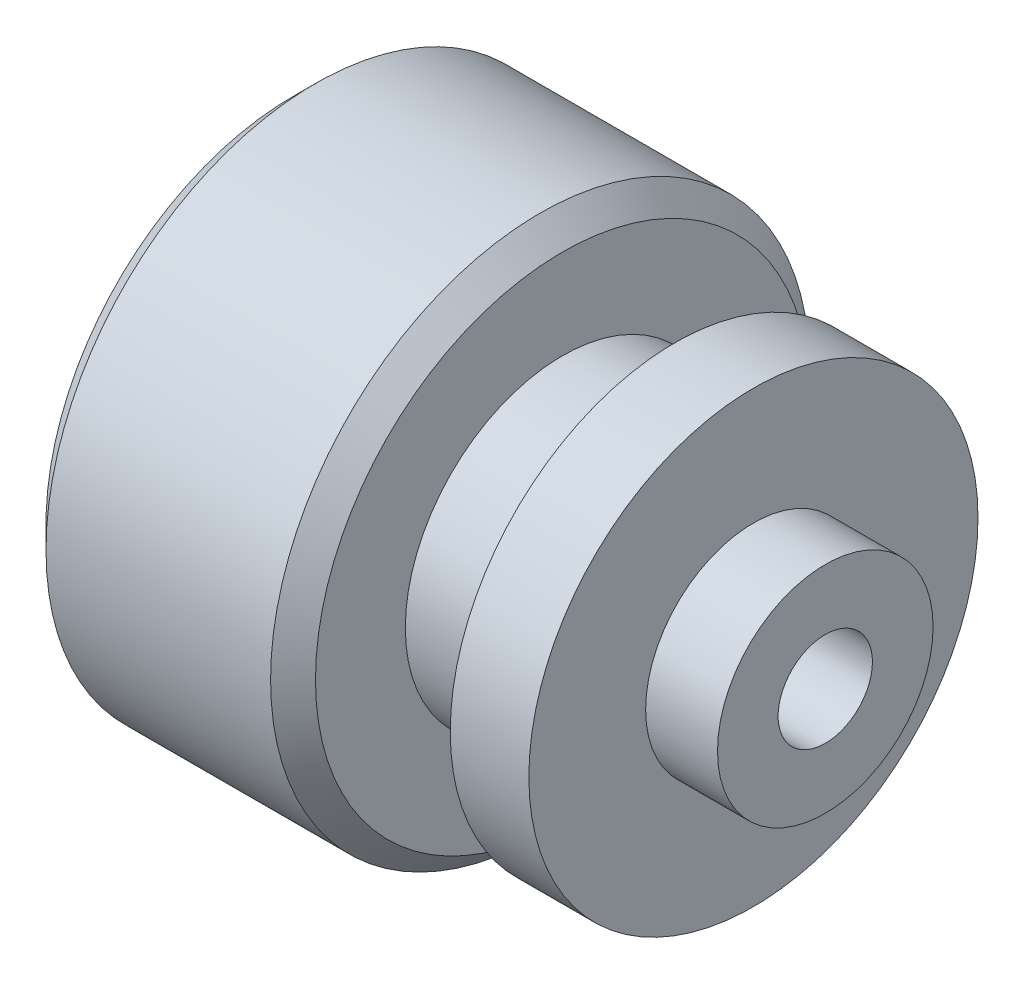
from build123d import *

# Parameters (mm, degrees)
M5_TAPPED_HOLE1_D = 4.2
SKETCH9_R         = 2.5
EXTRUDE1_DEPTH    = 12
CHAMFER1_SIZE     = 1


with BuildPart() as part:
    # Sketch1 → Revolve1 (revolve)
    with BuildSketch(Plane.XY, mode=Mode.PRIVATE) as revolve1_sk:
        Polygon((0, 0), (0, 12), (12, 12), (12, 7), (17, 7), (17, 10), (20.5, 10), (20.5, 4.8), (23.7, 4.8), (23.7, 0), align=None)
    revolve(revolve1_sk.sketch.rotate(Axis((0, 0, 0), (1, 0, 0)), 90), axis=Axis((0, 0, 0), (1, 0, 0)))

    # M5 Tapped Hole1 (through all)
    with Locations(Plane(origin=(23.7, 0, 0), x_dir=(0, 0, -1), z_dir=(1, 0, 0))):
        with Locations((0, 0)):
            Hole(M5_TAPPED_HOLE1_D / 2)

    # Sketch9 → Extrude1 (cut)
    with BuildSketch(Plane.ZY):
        Circle(SKETCH9_R)
    extrude(amount=-EXTRUDE1_DEPTH, mode=Mode.SUBTRACT)

    # Chamfer1
    chamfer1_edges = [part.edges().sort_by_distance(p)[0] for p in [
        (12, 0, -12),
        (0, 0, -12),
    ]]
    chamfer(chamfer1_edges, length=CHAMFER1_SIZE)


solid = part.part
